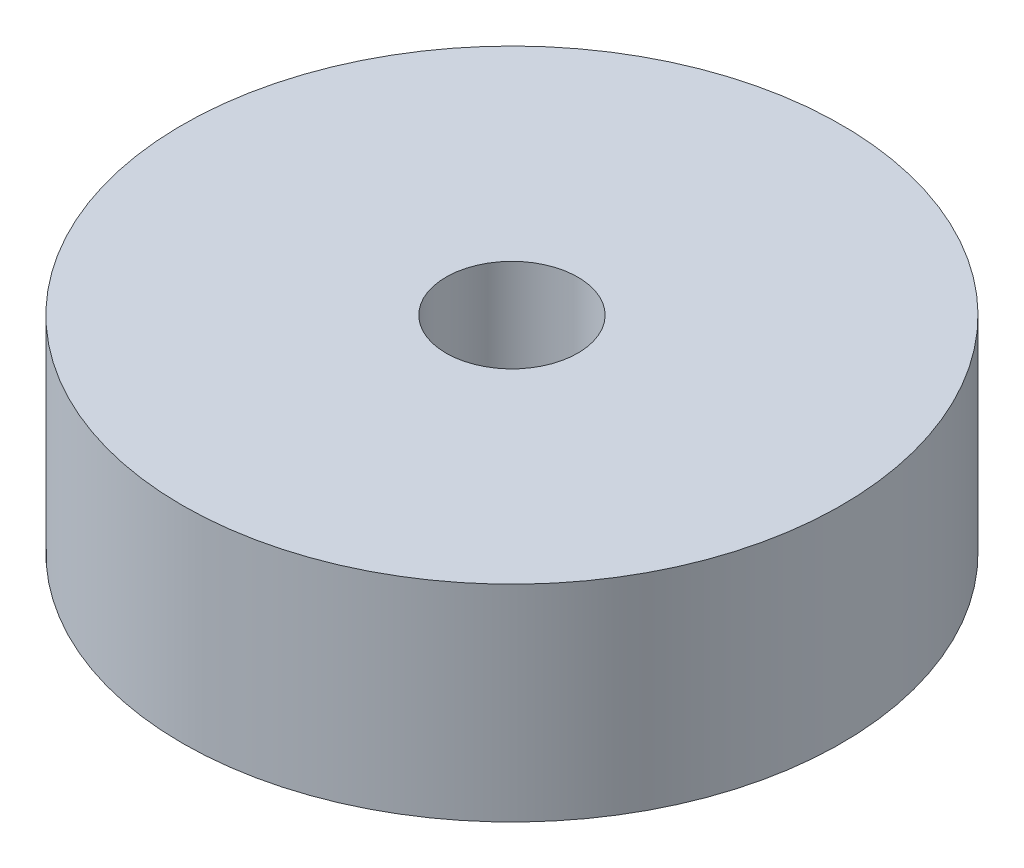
from build123d import *

# Parameters (mm, degrees)
SKETCH1_R           = 8
SKETCH1_R_2         = 1.6
BOSS_EXTRUDE1_DEPTH = 5


with BuildPart() as part:
    # Sketch1 → Boss-Extrude1 (new body)
    with BuildSketch(Plane(origin=(0, 0, 0), x_dir=(1, 0, 0), z_dir=(0, 1, 0))):
        with Locations(Location((0, 0, 0), (0, 0, 270))):
            Circle(SKETCH1_R)
        with Locations(Location((0, 0, 0), (0, 0, 270))):
            Circle(SKETCH1_R_2, mode=Mode.SUBTRACT)
    extrude(amount=BOSS_EXTRUDE1_DEPTH)


solid = part.part
